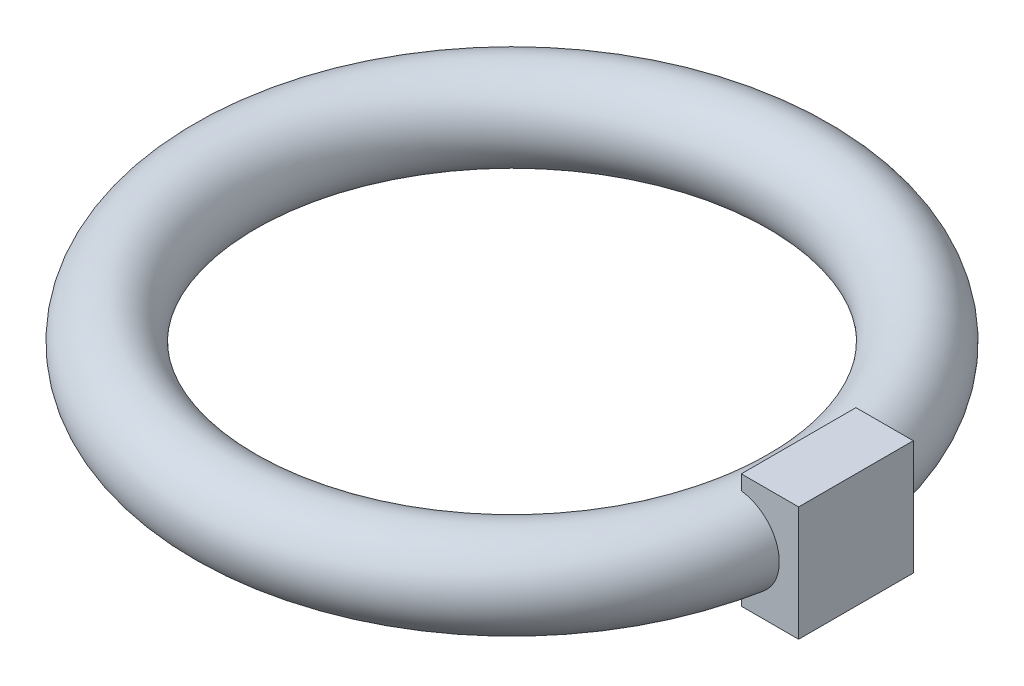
ISO-10303-21;
HEADER;
FILE_DESCRIPTION(('STEP AP214'),'2;1');
FILE_NAME('part.step','',(''),(''),'','','');
FILE_SCHEMA(('AUTOMOTIVE_DESIGN { 1 0 10303 214 1 1 1 1 }'));
ENDSEC;
DATA;
#1=APPLICATION_CONTEXT('core data for automotive mechanical design processes');
#2=APPLICATION_PROTOCOL_DEFINITION('international standard','automotive_design',2000,#1);
#3=PRODUCT_CONTEXT('',#1,'mechanical');
#4=PRODUCT('Part','Part','',(#3));
#5=PRODUCT_RELATED_PRODUCT_CATEGORY('part','',(#4));
#6=PRODUCT_DEFINITION_FORMATION('','',#4);
#7=PRODUCT_DEFINITION_CONTEXT('part definition',#1,'design');
#8=PRODUCT_DEFINITION('design','',#6,#7);
#9=PRODUCT_DEFINITION_SHAPE('','',#8);
#10=(LENGTH_UNIT() NAMED_UNIT(*) SI_UNIT(.MILLI.,.METRE.));
#11=(NAMED_UNIT(*) PLANE_ANGLE_UNIT() SI_UNIT($,.RADIAN.));
#12=(NAMED_UNIT(*) SI_UNIT($,.STERADIAN.) SOLID_ANGLE_UNIT());
#13=UNCERTAINTY_MEASURE_WITH_UNIT(LENGTH_MEASURE(1.E-05),#10,'distance_accuracy_value','');
#14=(GEOMETRIC_REPRESENTATION_CONTEXT(3) GLOBAL_UNCERTAINTY_ASSIGNED_CONTEXT((#13)) GLOBAL_UNIT_ASSIGNED_CONTEXT((#10,
#11,#12)) REPRESENTATION_CONTEXT('',''));
#15=CARTESIAN_POINT('',(0.,0.,0.));
#16=DIRECTION('',(0.,0.,1.));
#17=DIRECTION('',(1.,0.,0.));
#18=AXIS2_PLACEMENT_3D('',#15,#16,#17);
#19=CARTESIAN_POINT('',(100.,10.,-10.));
#20=DIRECTION('',(0.,0.,-1.));
#21=DIRECTION('',(-1.,0.,0.));
#22=AXIS2_PLACEMENT_3D('',#19,#20,#21);
#23=PLANE('',#22);
#24=CARTESIAN_POINT('',(102.409991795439,-6.70751476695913,-10.));
#25=CARTESIAN_POINT('',(102.214356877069,-6.80364922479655,-10.));
#26=CARTESIAN_POINT('',(102.014640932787,-6.89143819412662,-10.));
#27=CARTESIAN_POINT('',(101.608421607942,-7.04980923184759,-10.));
#28=CARTESIAN_POINT('',(101.40191616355,-7.12038601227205,-10.));
#29=CARTESIAN_POINT('',(100.983466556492,-7.24391992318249,-10.));
#30=CARTESIAN_POINT('',(100.771516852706,-7.29685826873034,-10.));
#31=CARTESIAN_POINT('',(100.343833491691,-7.38471512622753,-10.));
#32=CARTESIAN_POINT('',(100.128098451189,-7.41962690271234,-10.));
#33=CARTESIAN_POINT('',(99.6947586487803,-7.47117090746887,-10.));
#34=CARTESIAN_POINT('',(99.477156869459,-7.48782823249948,-10.));
#35=CARTESIAN_POINT('',(99.0412432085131,-7.50287672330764,-10.));
#36=CARTESIAN_POINT('',(98.8229310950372,-7.5012611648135,-10.));
#37=CARTESIAN_POINT('',(98.3873455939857,-7.47979390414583,-10.));
#38=CARTESIAN_POINT('',(98.1700716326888,-7.45995383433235,-10.));
#39=CARTESIAN_POINT('',(97.7378574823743,-7.40219437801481,-10.));
#40=CARTESIAN_POINT('',(97.5229182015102,-7.36426819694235,-10.));
#41=CARTESIAN_POINT('',(97.0954188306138,-7.27025564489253,-10.));
#42=CARTESIAN_POINT('',(96.8828871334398,-7.21404010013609,-10.));
#43=CARTESIAN_POINT('',(96.4632176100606,-7.08387597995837,-10.));
#44=CARTESIAN_POINT('',(96.2560823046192,-7.00991927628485,-10.));
#45=CARTESIAN_POINT('',(95.8487807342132,-6.84476733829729,-10.));
#46=CARTESIAN_POINT('',(95.6486150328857,-6.75357071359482,-10.));
#47=CARTESIAN_POINT('',(95.2568224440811,-6.55458729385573,-10.));
#48=CARTESIAN_POINT('',(95.0651916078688,-6.44680827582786,-10.));
#49=CARTESIAN_POINT('',(94.6921889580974,-6.21558370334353,-10.));
#50=CARTESIAN_POINT('',(94.5107961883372,-6.09217196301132,-10.));
#51=CARTESIAN_POINT('',(94.1592703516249,-5.83037041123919,-10.));
#52=CARTESIAN_POINT('',(93.9891328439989,-5.69198656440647,-10.));
#53=CARTESIAN_POINT('',(93.6613011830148,-5.4010794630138,-10.));
#54=CARTESIAN_POINT('',(93.5036112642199,-5.24855143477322,-10.));
#55=CARTESIAN_POINT('',(93.2020570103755,-4.93050348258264,-10.));
#56=CARTESIAN_POINT('',(93.0581870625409,-4.76498888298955,-10.));
#57=CARTESIAN_POINT('',(92.7877468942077,-4.42504647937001,-10.));
#58=CARTESIAN_POINT('',(92.6609201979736,-4.25082270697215,-10.));
#59=CARTESIAN_POINT('',(92.4227709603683,-3.89217415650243,-10.));
#60=CARTESIAN_POINT('',(92.31144245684,-3.70775333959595,-10.));
#61=CARTESIAN_POINT('',(92.1051642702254,-3.32995084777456,-10.));
#62=CARTESIAN_POINT('',(92.0102155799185,-3.13656863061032,-10.));
#63=CARTESIAN_POINT('',(91.8375293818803,-2.74226578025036,-10.));
#64=CARTESIAN_POINT('',(91.7597915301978,-2.54134529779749,-10.));
#65=CARTESIAN_POINT('',(91.6240040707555,-2.13876585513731,-10.));
#66=CARTESIAN_POINT('',(91.5654956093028,-1.93726156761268,-10.));
#67=CARTESIAN_POINT('',(91.4659652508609,-1.52998077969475,-10.));
#68=CARTESIAN_POINT('',(91.4249429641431,-1.32420437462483,-10.));
#69=CARTESIAN_POINT('',(91.3607466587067,-0.909907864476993,-10.));
#70=CARTESIAN_POINT('',(91.3375707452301,-0.701388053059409,-10.));
#71=CARTESIAN_POINT('',(91.3092652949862,-0.283127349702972,-10.));
#72=CARTESIAN_POINT('',(91.3041355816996,-0.0733864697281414,-10.));
#73=CARTESIAN_POINT('',(91.3118916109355,0.341715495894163,-10.));
#74=CARTESIAN_POINT('',(91.324432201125,0.547083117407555,-10.));
#75=CARTESIAN_POINT('',(91.3668135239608,0.956096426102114,-10.));
#76=CARTESIAN_POINT('',(91.3966601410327,1.1597415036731,-10.));
#77=CARTESIAN_POINT('',(91.4733965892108,1.56374796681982,-10.));
#78=CARTESIAN_POINT('',(91.5202827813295,1.76411004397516,-10.));
#79=CARTESIAN_POINT('',(91.6307078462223,2.16019519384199,-10.));
#80=CARTESIAN_POINT('',(91.6942471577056,2.35591814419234,-10.));
#81=CARTESIAN_POINT('',(91.8374724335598,2.74141608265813,-10.));
#82=CARTESIAN_POINT('',(91.9171623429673,2.9311896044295,-10.));
#83=CARTESIAN_POINT('',(92.0920389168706,3.30345821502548,-10.));
#84=CARTESIAN_POINT('',(92.1872258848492,3.48595316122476,-10.));
#85=CARTESIAN_POINT('',(92.3923355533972,3.84243207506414,-10.));
#86=CARTESIAN_POINT('',(92.50225643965,4.01641708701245,-10.));
#87=CARTESIAN_POINT('',(92.7360438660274,4.35483621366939,-10.));
#88=CARTESIAN_POINT('',(92.8599152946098,4.51926694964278,-10.));
#89=CARTESIAN_POINT('',(93.1230849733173,4.84044269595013,-10.));
#90=CARTESIAN_POINT('',(93.2626276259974,4.99698745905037,-10.));
#91=CARTESIAN_POINT('',(93.5542073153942,5.2980792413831,-10.));
#92=CARTESIAN_POINT('',(93.7062489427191,5.44262181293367,-10.));
#93=CARTESIAN_POINT('',(94.0216362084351,5.71870692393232,-10.));
#94=CARTESIAN_POINT('',(94.1849788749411,5.85025285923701,-10.));
#95=CARTESIAN_POINT('',(94.5219097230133,6.09962751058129,-10.));
#96=CARTESIAN_POINT('',(94.6955017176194,6.21745107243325,-10.));
#97=CARTESIAN_POINT('',(95.0561696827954,6.44140136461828,-10.));
#98=CARTESIAN_POINT('',(95.2434752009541,6.54715855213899,-10.));
#99=CARTESIAN_POINT('',(95.6262762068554,6.74281764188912,-10.));
#100=CARTESIAN_POINT('',(95.8217747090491,6.83271364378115,-10.));
#101=CARTESIAN_POINT('',(96.2195118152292,6.99603081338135,-10.));
#102=CARTESIAN_POINT('',(96.4217497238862,7.06945367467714,-10.));
#103=CARTESIAN_POINT('',(96.8315960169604,7.19937510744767,-10.));
#104=CARTESIAN_POINT('',(97.0392045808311,7.25587311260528,-10.));
#105=CARTESIAN_POINT('',(97.462216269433,7.35245769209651,-10.));
#106=CARTESIAN_POINT('',(97.6776925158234,7.39222430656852,-10.));
#107=CARTESIAN_POINT('',(98.111222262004,7.45355338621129,-10.));
#108=CARTESIAN_POINT('',(98.3292757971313,7.47511560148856,-10.));
#109=CARTESIAN_POINT('',(98.7664348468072,7.49987289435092,-10.));
#110=CARTESIAN_POINT('',(98.9855404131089,7.50306705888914,-10.));
#111=CARTESIAN_POINT('',(99.4232405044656,7.49103619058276,-10.));
#112=CARTESIAN_POINT('',(99.6418350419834,7.47581161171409,-10.));
#113=CARTESIAN_POINT('',(100.077859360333,7.42691043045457,-10.));
#114=CARTESIAN_POINT('',(100.295280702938,7.39315850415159,-10.));
#115=CARTESIAN_POINT('',(100.726403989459,7.30735558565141,-10.));
#116=CARTESIAN_POINT('',(100.940107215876,7.25531103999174,-10.));
#117=CARTESIAN_POINT('',(101.362350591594,7.13322304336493,-10.));
#118=CARTESIAN_POINT('',(101.57088985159,7.06317651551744,-10.));
#119=CARTESIAN_POINT('',(101.981219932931,6.90553132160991,-10.));
#120=CARTESIAN_POINT('',(102.183010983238,6.81793325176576,-10.));
#121=CARTESIAN_POINT('',(102.576489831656,6.62665277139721,-10.));
#122=CARTESIAN_POINT('',(102.768254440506,6.52312836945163,-10.));
#123=CARTESIAN_POINT('',(103.142246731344,6.30009587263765,-10.));
#124=CARTESIAN_POINT('',(103.324474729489,6.18058830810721,-10.));
#125=CARTESIAN_POINT('',(103.678044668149,5.92637462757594,-10.));
#126=CARTESIAN_POINT('',(103.84938501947,5.79166630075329,-10.));
#127=CARTESIAN_POINT('',(104.179767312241,5.50805109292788,-10.));
#128=CARTESIAN_POINT('',(104.338814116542,5.35914987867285,-10.));
#129=CARTESIAN_POINT('',(104.641001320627,5.05064810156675,-10.));
#130=CARTESIAN_POINT('',(104.78435566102,4.89125706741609,-10.));
#131=CARTESIAN_POINT('',(105.056878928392,4.56087387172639,-10.));
#132=CARTESIAN_POINT('',(105.186053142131,4.38988607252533,-10.));
#133=CARTESIAN_POINT('',(105.42928846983,4.03744882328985,-10.));
#134=CARTESIAN_POINT('',(105.543347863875,3.85599818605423,-10.));
#135=CARTESIAN_POINT('',(105.755440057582,3.48396013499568,-10.));
#136=CARTESIAN_POINT('',(105.853473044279,3.29337282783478,-10.));
#137=CARTESIAN_POINT('',(106.031271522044,2.90762922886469,-10.));
#138=CARTESIAN_POINT('',(106.111309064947,2.71259829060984,-10.));
#139=CARTESIAN_POINT('',(106.2545055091,2.31643487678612,-10.));
#140=CARTESIAN_POINT('',(106.317664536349,2.1153024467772,-10.));
#141=CARTESIAN_POINT('',(106.4266088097,1.70839522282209,-10.));
#142=CARTESIAN_POINT('',(106.472394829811,1.50262063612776,-10.));
#143=CARTESIAN_POINT('',(106.546236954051,1.08791898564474,-10.));
#144=CARTESIAN_POINT('',(106.574293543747,0.878992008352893,-10.));
#145=CARTESIAN_POINT('',(106.612249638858,0.461795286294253,-10.));
#146=CARTESIAN_POINT('',(106.622343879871,0.253543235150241,-10.));
#147=CARTESIAN_POINT('',(106.624895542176,-0.163064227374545,-10.));
#148=CARTESIAN_POINT('',(106.617353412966,-0.371419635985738,-10.));
#149=CARTESIAN_POINT('',(106.584689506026,-0.78677106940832,-10.));
#150=CARTESIAN_POINT('',(106.559565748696,-0.993766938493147,-10.));
#151=CARTESIAN_POINT('',(106.491941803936,-1.4048269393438,-10.));
#152=CARTESIAN_POINT('',(106.449447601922,-1.608892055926,-10.));
#153=CARTESIAN_POINT('',(106.34754515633,-2.01217614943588,-10.));
#154=CARTESIAN_POINT('',(106.28818216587,-2.2114065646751,-10.));
#155=CARTESIAN_POINT('',(106.15294970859,-2.60417750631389,-10.));
#156=CARTESIAN_POINT('',(106.077080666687,-2.7977181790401,-10.));
#157=CARTESIAN_POINT('',(105.909384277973,-3.17782055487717,-10.));
#158=CARTESIAN_POINT('',(105.817552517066,-3.36438031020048,-10.));
#159=CARTESIAN_POINT('',(105.618633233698,-3.72917792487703,-10.));
#160=CARTESIAN_POINT('',(105.511545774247,-3.90741581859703,-10.));
#161=CARTESIAN_POINT('',(105.282144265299,-4.25551740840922,-10.));
#162=CARTESIAN_POINT('',(105.159733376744,-4.4253172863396,-10.));
#163=CARTESIAN_POINT('',(104.901210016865,-4.75404515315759,-10.));
#164=CARTESIAN_POINT('',(104.765102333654,-4.91297690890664,-10.));
#165=CARTESIAN_POINT('',(104.480268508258,-5.21884169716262,-10.));
#166=CARTESIAN_POINT('',(104.331553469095,-5.36578506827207,-10.));
#167=CARTESIAN_POINT('',(104.022528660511,-5.6468224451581,-10.));
#168=CARTESIAN_POINT('',(103.86222192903,-5.78091979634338,-10.));
#169=CARTESIAN_POINT('',(103.496182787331,-6.0623000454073,-10.));
#170=CARTESIAN_POINT('',(103.287996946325,-6.20640594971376,-10.));
#171=CARTESIAN_POINT('',(102.858368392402,-6.47325589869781,-10.));
#172=CARTESIAN_POINT('',(102.636925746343,-6.59600005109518,-10.));
#173=CARTESIAN_POINT('',(102.409991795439,-6.70751476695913,-10.));
#174=B_SPLINE_CURVE_WITH_KNOTS('',3,(#24,#25,#26,#27,#28,#29,#30,#31,#32,#33,#34,#35,#36,#37,
#38,#39,#40,#41,#42,#43,#44,#45,#46,#47,#48,#49,#50,#51,#52,#53,#54,#55,#56,#57,#58,#59,#60,#61,
#62,#63,#64,#65,#66,#67,#68,#69,#70,#71,#72,#73,#74,#75,#76,#77,#78,#79,#80,#81,#82,#83,#84,#85,
#86,#87,#88,#89,#90,#91,#92,#93,#94,#95,#96,#97,#98,#99,#100,#101,#102,#103,#104,#105,#106,#107,
#108,#109,#110,#111,#112,#113,#114,#115,#116,#117,#118,#119,#120,#121,#122,#123,#124,#125,#126,
#127,#128,#129,#130,#131,#132,#133,#134,#135,#136,#137,#138,#139,#140,#141,#142,#143,#144,#145,
#146,#147,#148,#149,#150,#151,#152,#153,#154,#155,#156,#157,#158,#159,#160,#161,#162,#163,#164,
#165,#166,#167,#168,#169,#170,#171,#172,#173),.UNSPECIFIED.,.T.,.F.,(4,2,2,2,2,2,2,2,2,2,2,2,2,
2,2,2,2,2,2,2,2,2,2,2,2,2,2,2,2,2,2,2,2,2,2,2,2,2,2,2,2,2,2,2,2,2,2,2,2,2,2,2,2,2,2,2,2,2,2,2,2,
2,2,2,2,2,2,2,2,2,2,2,2,2,4),(0.,0.653710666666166,1.30762191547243,1.96222737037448,
2.61707723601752,3.27102566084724,3.92521474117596,4.57898655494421,5.23300417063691,
5.89174506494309,6.55078834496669,7.20988479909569,7.86867307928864,8.52605996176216,
9.18318591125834,9.84053445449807,10.4976148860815,11.1433145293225,11.78876508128,
12.4342547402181,13.0797314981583,13.7084460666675,14.3371466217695,14.9657804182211,
15.5944080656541,16.2109256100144,16.827652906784,17.4442485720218,18.0608604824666,
18.6776231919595,19.2943979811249,19.9110968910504,20.5280125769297,21.1564210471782,
21.7850613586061,22.4135369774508,23.0422478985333,23.6868009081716,24.3315931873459,
24.9763191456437,25.6210666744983,26.2776378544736,26.9342180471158,27.590830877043,
28.2474275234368,28.9067135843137,29.5657675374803,30.2249342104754,30.8840784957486,
31.537061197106,32.190022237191,32.8430783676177,33.4958748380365,34.1382172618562,
34.7803193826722,35.422494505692,36.0646621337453,36.6963480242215,37.3280291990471,
37.9596822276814,38.5913179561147,39.2160632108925,39.8407925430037,40.4655922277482,
41.0901768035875,41.7131014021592,42.3360099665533,42.9590910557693,43.5821695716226,
44.2094059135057,44.8364237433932,45.4628949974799,46.0892026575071,46.847502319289,
47.6057981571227),.UNSPECIFIED.);
#175=CARTESIAN_POINT('',(100.,7.43434688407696,-10.));
#176=VERTEX_POINT('',#175);
#177=CARTESIAN_POINT('',(100.,-7.43434688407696,-10.));
#178=VERTEX_POINT('',#177);
#179=EDGE_CURVE('E37',#176,#178,#174,.T.);
#180=ORIENTED_EDGE('',*,*,#179,.F.);
#181=DIRECTION('',(0.,1.,0.));
#182=VECTOR('',#181,1.);
#183=CARTESIAN_POINT('',(100.,10.,-10.));
#184=LINE('',#183,#182);
#185=CARTESIAN_POINT('',(100.,10.,-10.));
#186=VERTEX_POINT('',#185);
#187=EDGE_CURVE('E53',#176,#186,#184,.T.);
#188=ORIENTED_EDGE('',*,*,#187,.T.);
#189=DIRECTION('',(1.,0.,0.));
#190=VECTOR('',#189,1.);
#191=CARTESIAN_POINT('',(100.,10.,-10.));
#192=LINE('',#191,#190);
#193=CARTESIAN_POINT('',(110.,10.,-10.));
#194=VERTEX_POINT('',#193);
#195=EDGE_CURVE('E92',#186,#194,#192,.T.);
#196=ORIENTED_EDGE('',*,*,#195,.T.);
#197=DIRECTION('',(0.,1.,0.));
#198=VECTOR('',#197,1.);
#199=CARTESIAN_POINT('',(110.,10.,-10.));
#200=LINE('',#199,#198);
#201=CARTESIAN_POINT('',(110.,-10.,-10.));
#202=VERTEX_POINT('',#201);
#203=EDGE_CURVE('E119',#202,#194,#200,.T.);
#204=ORIENTED_EDGE('',*,*,#203,.F.);
#205=DIRECTION('',(1.,0.,0.));
#206=VECTOR('',#205,1.);
#207=CARTESIAN_POINT('',(100.,-10.,-10.));
#208=LINE('',#207,#206);
#209=CARTESIAN_POINT('',(100.,-10.,-10.));
#210=VERTEX_POINT('',#209);
#211=EDGE_CURVE('E127',#210,#202,#208,.T.);
#212=ORIENTED_EDGE('',*,*,#211,.F.);
#213=EDGE_CURVE('E97',#210,#178,#184,.T.);
#214=ORIENTED_EDGE('',*,*,#213,.T.);
#215=EDGE_LOOP('',(#180,#188,#196,#204,#212,#214));
#216=FACE_BOUND('',#215,.T.);
#217=ADVANCED_FACE('F32',(#216),#23,.T.);
#218=CARTESIAN_POINT('',(100.,10.,10.));
#219=DIRECTION('',(0.,0.,1.));
#220=DIRECTION('',(1.,0.,0.));
#221=AXIS2_PLACEMENT_3D('',#218,#219,#220);
#222=PLANE('',#221);
#223=CARTESIAN_POINT('',(102.409991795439,-6.70751476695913,10.));
#224=CARTESIAN_POINT('',(102.601083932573,-6.61361595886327,10.));
#225=CARTESIAN_POINT('',(102.788238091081,-6.51177532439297,10.));
#226=CARTESIAN_POINT('',(103.153453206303,-6.2927982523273,10.));
#227=CARTESIAN_POINT('',(103.331512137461,-6.17565842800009,10.));
#228=CARTESIAN_POINT('',(103.677308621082,-5.92677142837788,10.));
#229=CARTESIAN_POINT('',(103.845038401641,-5.79501345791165,10.));
#230=CARTESIAN_POINT('',(104.168859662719,-5.51778117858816,10.));
#231=CARTESIAN_POINT('',(104.324946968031,-5.37230199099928,10.));
#232=CARTESIAN_POINT('',(104.624258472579,-5.06864036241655,10.));
#233=CARTESIAN_POINT('',(104.767481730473,-4.91045699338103,10.));
#234=CARTESIAN_POINT('',(105.039966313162,-4.58248654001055,10.));
#235=CARTESIAN_POINT('',(105.169227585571,-4.41269941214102,10.));
#236=CARTESIAN_POINT('',(105.412763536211,-4.06275752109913,10.));
#237=CARTESIAN_POINT('',(105.527041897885,-3.88260532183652,10.));
#238=CARTESIAN_POINT('',(105.739762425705,-3.51317639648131,10.));
#239=CARTESIAN_POINT('',(105.838204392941,-3.32389955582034,10.));
#240=CARTESIAN_POINT('',(106.017406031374,-2.93988678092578,10.));
#241=CARTESIAN_POINT('',(106.098361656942,-2.74524227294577,10.));
#242=CARTESIAN_POINT('',(106.243452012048,-2.34970338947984,10.));
#243=CARTESIAN_POINT('',(106.307580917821,-2.14880687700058,10.));
#244=CARTESIAN_POINT('',(106.41845871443,-1.74235613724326,10.));
#245=CARTESIAN_POINT('',(106.465214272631,-1.53680372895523,10.));
#246=CARTESIAN_POINT('',(106.54102733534,-1.12238124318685,10.));
#247=CARTESIAN_POINT('',(106.570078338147,-0.913509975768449,10.));
#248=CARTESIAN_POINT('',(106.610001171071,-0.496404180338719,10.));
#249=CARTESIAN_POINT('',(106.621073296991,-0.288188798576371,10.));
#250=CARTESIAN_POINT('',(106.625579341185,0.12843569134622,10.));
#251=CARTESIAN_POINT('',(106.619013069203,0.336844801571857,10.));
#252=CARTESIAN_POINT('',(106.588293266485,0.752351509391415,10.));
#253=CARTESIAN_POINT('',(106.564140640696,0.959449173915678,10.));
#254=CARTESIAN_POINT('',(106.498434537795,1.37087025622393,10.));
#255=CARTESIAN_POINT('',(106.456880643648,1.57519360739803,10.));
#256=CARTESIAN_POINT('',(106.356843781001,1.97899251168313,10.));
#257=CARTESIAN_POINT('',(106.298412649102,2.1784809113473,10.));
#258=CARTESIAN_POINT('',(106.164993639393,2.57191767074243,10.));
#259=CARTESIAN_POINT('',(106.0900000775,2.7658641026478,10.));
#260=CARTESIAN_POINT('',(105.924048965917,3.14675974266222,10.));
#261=CARTESIAN_POINT('',(105.833094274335,3.3337101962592,10.));
#262=CARTESIAN_POINT('',(105.635890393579,3.69936662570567,10.));
#263=CARTESIAN_POINT('',(105.529640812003,3.87807238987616,10.));
#264=CARTESIAN_POINT('',(105.301969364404,4.22704070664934,10.));
#265=CARTESIAN_POINT('',(105.180462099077,4.39724754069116,10.));
#266=CARTESIAN_POINT('',(104.923669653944,4.72693328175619,10.));
#267=CARTESIAN_POINT('',(104.788384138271,4.88641192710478,10.));
#268=CARTESIAN_POINT('',(104.505048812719,5.19355113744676,10.));
#269=CARTESIAN_POINT('',(104.35700083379,5.34121339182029,10.));
#270=CARTESIAN_POINT('',(104.049140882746,5.62382724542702,10.));
#271=CARTESIAN_POINT('',(103.889324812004,5.75877437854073,10.));
#272=CARTESIAN_POINT('',(103.557004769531,6.01666968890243,10.));
#273=CARTESIAN_POINT('',(103.384364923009,6.13944279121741,10.));
#274=CARTESIAN_POINT('',(103.029413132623,6.37025495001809,10.));
#275=CARTESIAN_POINT('',(102.847097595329,6.4782884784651,10.));
#276=CARTESIAN_POINT('',(102.474213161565,6.67885362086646,10.));
#277=CARTESIAN_POINT('',(102.283647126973,6.77139055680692,10.));
#278=CARTESIAN_POINT('',(101.895450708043,6.9404791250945,10.));
#279=CARTESIAN_POINT('',(101.69781716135,7.01702349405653,10.));
#280=CARTESIAN_POINT('',(101.29356078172,7.1547675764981,10.));
#281=CARTESIAN_POINT('',(101.086842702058,7.21568784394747,10.));
#282=CARTESIAN_POINT('',(100.669145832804,7.32009208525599,10.));
#283=CARTESIAN_POINT('',(100.458168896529,7.36358347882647,10.));
#284=CARTESIAN_POINT('',(100.033236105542,7.4329394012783,10.));
#285=CARTESIAN_POINT('',(99.819278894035,7.45879561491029,10.));
#286=CARTESIAN_POINT('',(99.3900374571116,7.49271070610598,10.));
#287=CARTESIAN_POINT('',(99.17475373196,7.50077592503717,10.));
#288=CARTESIAN_POINT('',(98.7409536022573,7.49909383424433,10.));
#289=CARTESIAN_POINT('',(98.5224382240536,7.4890716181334,10.));
#290=CARTESIAN_POINT('',(98.0870921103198,7.45077581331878,10.));
#291=CARTESIAN_POINT('',(97.8702608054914,7.42250869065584,10.));
#292=CARTESIAN_POINT('',(97.4396316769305,7.34791660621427,10.));
#293=CARTESIAN_POINT('',(97.2258351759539,7.30158400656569,10.));
#294=CARTESIAN_POINT('',(96.802952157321,7.19119505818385,10.));
#295=CARTESIAN_POINT('',(96.5938639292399,7.12714526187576,10.));
#296=CARTESIAN_POINT('',(96.18043507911,6.98125522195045,10.));
#297=CARTESIAN_POINT('',(95.9761348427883,6.89930047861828,10.));
#298=CARTESIAN_POINT('',(95.5752744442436,6.71842227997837,10.));
#299=CARTESIAN_POINT('',(95.3787115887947,6.61950479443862,10.));
#300=CARTESIAN_POINT('',(94.9946590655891,6.40530994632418,10.));
#301=CARTESIAN_POINT('',(94.8071711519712,6.29002943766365,10.));
#302=CARTESIAN_POINT('',(94.4427228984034,6.04388849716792,10.));
#303=CARTESIAN_POINT('',(94.2657621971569,5.91302860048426,10.));
#304=CARTESIAN_POINT('',(93.9251197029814,5.63773113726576,10.));
#305=CARTESIAN_POINT('',(93.7613413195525,5.49341310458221,10.));
#306=CARTESIAN_POINT('',(93.4467515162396,5.19128188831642,10.));
#307=CARTESIAN_POINT('',(93.295939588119,5.033469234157,10.));
#308=CARTESIAN_POINT('',(93.0084645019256,4.70540392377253,10.));
#309=CARTESIAN_POINT('',(92.8718031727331,4.53514966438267,10.));
#310=CARTESIAN_POINT('',(92.6138318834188,4.18348485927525,10.));
#311=CARTESIAN_POINT('',(92.4925156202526,4.00207893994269,10.));
#312=CARTESIAN_POINT('',(92.268659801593,3.63340443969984,10.));
#313=CARTESIAN_POINT('',(92.1657698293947,3.44634859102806,10.));
#314=CARTESIAN_POINT('',(91.9765053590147,3.06414564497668,10.));
#315=CARTESIAN_POINT('',(91.8901244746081,2.86900171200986,10.));
#316=CARTESIAN_POINT('',(91.7345691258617,2.47195747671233,10.));
#317=CARTESIAN_POINT('',(91.6653956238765,2.27005679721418,10.));
#318=CARTESIAN_POINT('',(91.5448719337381,1.86100362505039,10.));
#319=CARTESIAN_POINT('',(91.493521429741,1.65385122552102,10.));
#320=CARTESIAN_POINT('',(91.4101758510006,1.24116326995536,10.));
#321=CARTESIAN_POINT('',(91.3777225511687,1.03572014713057,10.));
#322=CARTESIAN_POINT('',(91.3304627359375,0.622814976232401,10.));
#323=CARTESIAN_POINT('',(91.3156559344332,0.415352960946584,10.));
#324=CARTESIAN_POINT('',(91.3038184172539,-5.96479183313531E-05,10.));
#325=CARTESIAN_POINT('',(91.3067861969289,-0.208010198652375,10.));
#326=CARTESIAN_POINT('',(91.3304684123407,-0.622897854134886,10.));
#327=CARTESIAN_POINT('',(91.3511827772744,-0.82983496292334,10.));
#328=CARTESIAN_POINT('',(91.4097908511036,-1.23849468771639,10.));
#329=CARTESIAN_POINT('',(91.4474562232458,-1.44025010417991,10.));
#330=CARTESIAN_POINT('',(91.5395950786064,-1.8399571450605,10.));
#331=CARTESIAN_POINT('',(91.5940742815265,-2.03790745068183,10.));
#332=CARTESIAN_POINT('',(91.7193637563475,-2.42849197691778,10.));
#333=CARTESIAN_POINT('',(91.790168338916,-2.62112802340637,10.));
#334=CARTESIAN_POINT('',(91.9475739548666,-2.99991566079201,10.));
#335=CARTESIAN_POINT('',(92.034180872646,-3.18606480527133,10.));
#336=CARTESIAN_POINT('',(92.2232007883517,-3.55194333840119,10.));
#337=CARTESIAN_POINT('',(92.3257284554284,-3.73161347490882,10.));
#338=CARTESIAN_POINT('',(92.5453427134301,-4.08191119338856,10.));
#339=CARTESIAN_POINT('',(92.6624346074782,-4.25253544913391,10.));
#340=CARTESIAN_POINT('',(92.9102416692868,-4.58355150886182,10.));
#341=CARTESIAN_POINT('',(93.0409552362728,-4.74394451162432,10.));
#342=CARTESIAN_POINT('',(93.3150553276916,-5.05351683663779,10.));
#343=CARTESIAN_POINT('',(93.4584424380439,-5.20269563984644,10.));
#344=CARTESIAN_POINT('',(93.7603070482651,-5.49222507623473,10.));
#345=CARTESIAN_POINT('',(93.9190567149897,-5.63229200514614,10.));
#346=CARTESIAN_POINT('',(94.2475797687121,-5.89883708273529,10.));
#347=CARTESIAN_POINT('',(94.4173533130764,-6.02531503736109,10.));
#348=CARTESIAN_POINT('',(94.7667258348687,-6.2639055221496,10.));
#349=CARTESIAN_POINT('',(94.9463254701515,-6.376017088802,10.));
#350=CARTESIAN_POINT('',(95.3140874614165,-6.58517771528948,10.));
#351=CARTESIAN_POINT('',(95.5022498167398,-6.68222677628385,10.));
#352=CARTESIAN_POINT('',(95.8905367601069,-6.86285071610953,10.));
#353=CARTESIAN_POINT('',(96.0908411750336,-6.94603922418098,10.));
#354=CARTESIAN_POINT('',(96.4976060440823,-7.09543342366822,10.));
#355=CARTESIAN_POINT('',(96.7040643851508,-7.16164487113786,10.));
#356=CARTESIAN_POINT('',(97.1219066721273,-7.27673513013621,10.));
#357=CARTESIAN_POINT('',(97.3332938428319,-7.32560223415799,10.));
#358=CARTESIAN_POINT('',(97.7593176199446,-7.40560423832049,10.));
#359=CARTESIAN_POINT('',(97.9739530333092,-7.4367454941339,10.));
#360=CARTESIAN_POINT('',(98.4081533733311,-7.48142320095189,10.));
#361=CARTESIAN_POINT('',(98.6277449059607,-7.49470160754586,10.));
#362=CARTESIAN_POINT('',(99.0671857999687,-7.50270548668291,10.));
#363=CARTESIAN_POINT('',(99.2870350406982,-7.49743760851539,10.));
#364=CARTESIAN_POINT('',(99.7253241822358,-7.46837757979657,10.));
#365=CARTESIAN_POINT('',(99.943765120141,-7.44460114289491,10.));
#366=CARTESIAN_POINT('',(100.377785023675,-7.3786808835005,10.));
#367=CARTESIAN_POINT('',(100.593364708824,-7.33654177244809,10.));
#368=CARTESIAN_POINT('',(101.083513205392,-7.21893172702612,10.));
#369=CARTESIAN_POINT('',(101.356622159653,-7.13728268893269,10.));
#370=CARTESIAN_POINT('',(101.892162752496,-6.9443227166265,10.));
#371=CARTESIAN_POINT('',(102.154594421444,-6.83301186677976,10.));
#372=CARTESIAN_POINT('',(102.409991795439,-6.70751476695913,10.));
#373=B_SPLINE_CURVE_WITH_KNOTS('',3,(#223,#224,#225,#226,#227,#228,#229,#230,#231,#232,#233,
#234,#235,#236,#237,#238,#239,#240,#241,#242,#243,#244,#245,#246,#247,#248,#249,#250,#251,#252,
#253,#254,#255,#256,#257,#258,#259,#260,#261,#262,#263,#264,#265,#266,#267,#268,#269,#270,#271,
#272,#273,#274,#275,#276,#277,#278,#279,#280,#281,#282,#283,#284,#285,#286,#287,#288,#289,#290,
#291,#292,#293,#294,#295,#296,#297,#298,#299,#300,#301,#302,#303,#304,#305,#306,#307,#308,#309,
#310,#311,#312,#313,#314,#315,#316,#317,#318,#319,#320,#321,#322,#323,#324,#325,#326,#327,#328,
#329,#330,#331,#332,#333,#334,#335,#336,#337,#338,#339,#340,#341,#342,#343,#344,#345,#346,#347,
#348,#349,#350,#351,#352,#353,#354,#355,#356,#357,#358,#359,#360,#361,#362,#363,#364,#365,#366,
#367,#368,#369,#370,#371,#372),.UNSPECIFIED.,.T.,.F.,(4,2,2,2,2,2,2,2,2,2,2,2,2,2,2,2,2,2,2,2,2,
2,2,2,2,2,2,2,2,2,2,2,2,2,2,2,2,2,2,2,2,2,2,2,2,2,2,2,2,2,2,2,2,2,2,2,2,2,2,2,2,2,2,2,2,2,2,2,2,
2,2,2,2,2,4),(0.,0.638506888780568,1.27715536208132,1.91627864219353,2.55563003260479,
3.19502817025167,3.83442870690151,4.47367175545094,5.11292283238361,5.74458867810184,
6.37647285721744,7.00811428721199,7.63998753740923,8.26477179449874,8.88956279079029,
9.51432163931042,10.1390954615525,10.7619704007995,11.385059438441,12.0080370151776,
12.6310305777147,13.2576810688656,13.8843468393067,14.5109228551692,15.1377181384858,
15.7725111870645,16.4075416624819,17.0423536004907,17.6774532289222,18.3232243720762,
18.9687203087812,19.6145203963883,20.2600902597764,20.9155547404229,21.5707870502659,
22.2262966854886,22.881564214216,23.5411515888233,24.2005073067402,24.8599899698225,
25.5194499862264,26.1735276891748,26.8275797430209,27.4817162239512,28.1355831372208,
28.7752568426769,29.4146825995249,30.0541441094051,30.6935942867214,31.3168128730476,
31.940021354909,32.5631770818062,33.1863303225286,33.8013296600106,34.4165384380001,
35.0315331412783,35.6467573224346,36.2666379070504,36.8867448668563,37.5067790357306,
38.1268418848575,38.7612348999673,39.3956369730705,40.0300815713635,40.6645261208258,
41.3144449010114,41.9641430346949,42.614278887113,43.2641814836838,43.9233751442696,
44.582332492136,45.2407309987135,45.8989606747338,46.7523366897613,47.6057102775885),.UNSPECIFIED.);
#374=CARTESIAN_POINT('',(100.,-7.43434688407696,10.));
#375=VERTEX_POINT('',#374);
#376=CARTESIAN_POINT('',(100.,7.43434688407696,10.));
#377=VERTEX_POINT('',#376);
#378=EDGE_CURVE('E61',#375,#377,#373,.T.);
#379=ORIENTED_EDGE('',*,*,#378,.F.);
#380=DIRECTION('',(0.,-1.,0.));
#381=VECTOR('',#380,1.);
#382=CARTESIAN_POINT('',(100.,10.,10.));
#383=LINE('',#382,#381);
#384=CARTESIAN_POINT('',(100.,-10.,10.));
#385=VERTEX_POINT('',#384);
#386=EDGE_CURVE('E113',#375,#385,#383,.T.);
#387=ORIENTED_EDGE('',*,*,#386,.T.);
#388=DIRECTION('',(1.,0.,0.));
#389=VECTOR('',#388,1.);
#390=CARTESIAN_POINT('',(100.,-10.,10.));
#391=LINE('',#390,#389);
#392=CARTESIAN_POINT('',(110.,-10.,10.));
#393=VERTEX_POINT('',#392);
#394=EDGE_CURVE('E129',#385,#393,#391,.T.);
#395=ORIENTED_EDGE('',*,*,#394,.T.);
#396=DIRECTION('',(0.,-1.,0.));
#397=VECTOR('',#396,1.);
#398=CARTESIAN_POINT('',(110.,10.,10.));
#399=LINE('',#398,#397);
#400=CARTESIAN_POINT('',(110.,10.,10.));
#401=VERTEX_POINT('',#400);
#402=EDGE_CURVE('E122',#401,#393,#399,.T.);
#403=ORIENTED_EDGE('',*,*,#402,.F.);
#404=DIRECTION('',(1.,0.,0.));
#405=VECTOR('',#404,1.);
#406=CARTESIAN_POINT('',(100.,10.,10.));
#407=LINE('',#406,#405);
#408=CARTESIAN_POINT('',(100.,10.,10.));
#409=VERTEX_POINT('',#408);
#410=EDGE_CURVE('E107',#409,#401,#407,.T.);
#411=ORIENTED_EDGE('',*,*,#410,.F.);
#412=EDGE_CURVE('E112',#409,#377,#383,.T.);
#413=ORIENTED_EDGE('',*,*,#412,.T.);
#414=EDGE_LOOP('',(#379,#387,#395,#403,#411,#413));
#415=FACE_BOUND('',#414,.T.);
#416=ADVANCED_FACE('F143',(#415),#222,.T.);
#417=CARTESIAN_POINT('',(100.,-10.,-10.));
#418=DIRECTION('',(-1.,0.,0.));
#419=DIRECTION('',(0.,0.,1.));
#420=AXIS2_PLACEMENT_3D('',#417,#418,#419);
#421=PLANE('',#420);
#422=CARTESIAN_POINT('',(100.,0.,-28.3945417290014));
#423=CARTESIAN_POINT('',(100.,-0.110428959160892,-28.3945420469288));
#424=CARTESIAN_POINT('',(100.,-0.220855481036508,-28.389592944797));
#425=CARTESIAN_POINT('',(100.,-0.440870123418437,-28.3699128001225));
#426=CARTESIAN_POINT('',(100.,-0.550457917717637,-28.3551781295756));
#427=CARTESIAN_POINT('',(100.,-0.76793797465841,-28.3162571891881));
#428=CARTESIAN_POINT('',(100.,-0.87583024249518,-28.2920709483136));
#429=CARTESIAN_POINT('',(100.,-1.08923411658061,-28.2347715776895));
#430=CARTESIAN_POINT('',(100.,-1.19474468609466,-28.2016546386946));
#431=CARTESIAN_POINT('',(100.,-1.50532416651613,-28.0903640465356));
#432=CARTESIAN_POINT('',(100.,-1.70610427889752,-27.9999375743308));
#433=CARTESIAN_POINT('',(100.,-2.0928681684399,-27.7921654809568));
#434=CARTESIAN_POINT('',(100.,-2.27884666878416,-27.6748103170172));
#435=CARTESIAN_POINT('',(100.,-2.754525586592,-27.3329841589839));
#436=CARTESIAN_POINT('',(100.,-3.03052370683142,-27.0893266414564));
#437=CARTESIAN_POINT('',(100.,-3.41353874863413,-26.6945542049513));
#438=CARTESIAN_POINT('',(100.,-3.53625615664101,-26.5577860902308));
#439=CARTESIAN_POINT('',(100.,-3.77205159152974,-26.2761571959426));
#440=CARTESIAN_POINT('',(100.,-3.88513151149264,-26.131298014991));
#441=CARTESIAN_POINT('',(100.,-4.18281657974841,-25.7251909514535));
#442=CARTESIAN_POINT('',(100.,-4.35830457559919,-25.4572664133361));
#443=CARTESIAN_POINT('',(100.,-4.68564381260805,-24.9072997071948));
#444=CARTESIAN_POINT('',(100.,-4.83747593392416,-24.6252463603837));
#445=CARTESIAN_POINT('',(100.,-5.12070513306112,-24.0507779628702));
#446=CARTESIAN_POINT('',(100.,-5.25208067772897,-23.7583523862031));
#447=CARTESIAN_POINT('',(100.,-5.49688103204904,-23.1662764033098));
#448=CARTESIAN_POINT('',(100.,-5.61031173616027,-22.8666284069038));
#449=CARTESIAN_POINT('',(100.,-5.86571663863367,-22.1357460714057));
#450=CARTESIAN_POINT('',(100.,-5.9998505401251,-21.7017790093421));
#451=CARTESIAN_POINT('',(100.,-6.24234397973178,-20.8266189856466));
#452=CARTESIAN_POINT('',(100.,-6.35069057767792,-20.385422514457));
#453=CARTESIAN_POINT('',(100.,-6.54606541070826,-19.497514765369));
#454=CARTESIAN_POINT('',(100.,-6.63305279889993,-19.0507946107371));
#455=CARTESIAN_POINT('',(100.,-6.78901486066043,-18.154347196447));
#456=CARTESIAN_POINT('',(100.,-6.8579925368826,-17.7046204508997));
#457=CARTESIAN_POINT('',(100.,-6.9813695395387,-16.8000589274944));
#458=CARTESIAN_POINT('',(100.,-7.03566559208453,-16.3452102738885));
#459=CARTESIAN_POINT('',(100.,-7.13164533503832,-15.434189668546));
#460=CARTESIAN_POINT('',(100.,-7.17332854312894,-14.9780176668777));
#461=CARTESIAN_POINT('',(100.,-7.24627067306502,-14.0653487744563));
#462=CARTESIAN_POINT('',(100.,-7.27754071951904,-13.6088527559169));
#463=CARTESIAN_POINT('',(100.,-7.33164791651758,-12.6953848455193));
#464=CARTESIAN_POINT('',(100.,-7.35448529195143,-12.2384129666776));
#465=CARTESIAN_POINT('',(100.,-7.39575085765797,-11.26945129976));
#466=CARTESIAN_POINT('',(100.,-7.41332358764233,-10.7574259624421));
#467=CARTESIAN_POINT('',(100.,-7.44207907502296,-9.73319158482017));
#468=CARTESIAN_POINT('',(100.,-7.45326166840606,-9.22098254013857));
#469=CARTESIAN_POINT('',(100.,-7.47099616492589,-8.19643369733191));
#470=CARTESIAN_POINT('',(100.,-7.47754756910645,-7.68409389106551));
#471=CARTESIAN_POINT('',(100.,-7.48749734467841,-6.6593909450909));
#472=CARTESIAN_POINT('',(100.,-7.49089574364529,-6.14702780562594));
#473=CARTESIAN_POINT('',(100.,-7.49574440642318,-5.12192265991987));
#474=CARTESIAN_POINT('',(100.,-7.49719325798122,-4.60918064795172));
#475=CARTESIAN_POINT('',(100.,-7.4990642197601,-3.58369457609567));
#476=CARTESIAN_POINT('',(100.,-7.4994863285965,-3.07095051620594));
#477=CARTESIAN_POINT('',(100.,-7.49994332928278,-2.04550358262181));
#478=CARTESIAN_POINT('',(100.,-7.49997825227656,-1.53280070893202));
#479=CARTESIAN_POINT('',(100.,-7.50000731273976,-0.507395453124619));
#480=CARTESIAN_POINT('',(100.,-7.50000145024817,0.0053069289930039));
#481=CARTESIAN_POINT('',(100.,-7.49999759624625,1.02917307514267));
#482=CARTESIAN_POINT('',(100.,-7.49999958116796,1.54033683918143));
#483=CARTESIAN_POINT('',(100.,-7.49976444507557,2.56266504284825));
#484=CARTESIAN_POINT('',(100.,-7.49952732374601,3.07382948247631));
#485=CARTESIAN_POINT('',(100.,-7.49827571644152,4.09620819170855));
#486=CARTESIAN_POINT('',(100.,-7.49726115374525,4.60742246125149));
#487=CARTESIAN_POINT('',(100.,-7.49363090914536,5.62984526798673));
#488=CARTESIAN_POINT('',(100.,-7.49101523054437,6.14105380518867));
#489=CARTESIAN_POINT('',(100.,-7.48308344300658,7.16307967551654));
#490=CARTESIAN_POINT('',(100.,-7.477769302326,7.67389702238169));
#491=CARTESIAN_POINT('',(100.,-7.46306853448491,8.69548349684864));
#492=CARTESIAN_POINT('',(100.,-7.45368185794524,9.20625262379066));
#493=CARTESIAN_POINT('',(100.,-7.42918914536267,10.227582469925));
#494=CARTESIAN_POINT('',(100.,-7.41408397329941,10.7381432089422));
#495=CARTESIAN_POINT('',(100.,-7.3762223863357,11.7589751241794));
#496=CARTESIAN_POINT('',(100.,-7.3534662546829,12.2692463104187));
#497=CARTESIAN_POINT('',(100.,-7.30477541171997,13.1654303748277));
#498=CARTESIAN_POINT('',(100.,-7.28095387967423,13.5514568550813));
#499=CARTESIAN_POINT('',(100.,-7.22651241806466,14.3230462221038));
#500=CARTESIAN_POINT('',(100.,-7.1958923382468,14.7086090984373));
#501=CARTESIAN_POINT('',(100.,-7.12658449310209,15.4792565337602));
#502=CARTESIAN_POINT('',(100.,-7.08789179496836,15.8643406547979));
#503=CARTESIAN_POINT('',(100.,-7.00103619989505,16.6334449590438));
#504=CARTESIAN_POINT('',(100.,-6.95287347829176,17.0174651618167));
#505=CARTESIAN_POINT('',(100.,-6.84547164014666,17.7839340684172));
#506=CARTESIAN_POINT('',(100.,-6.78623356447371,18.1663829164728));
#507=CARTESIAN_POINT('',(100.,-6.65481927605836,18.9291058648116));
#508=CARTESIAN_POINT('',(100.,-6.58264206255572,19.3093797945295));
#509=CARTESIAN_POINT('',(100.,-6.42327405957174,20.0663960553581));
#510=CARTESIAN_POINT('',(100.,-6.33609871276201,20.4431416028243));
#511=CARTESIAN_POINT('',(100.,-6.14416198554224,21.1920813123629));
#512=CARTESIAN_POINT('',(100.,-6.03940476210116,21.564276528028));
#513=CARTESIAN_POINT('',(100.,-5.807780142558,22.3070132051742));
#514=CARTESIAN_POINT('',(100.,-5.68064763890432,22.6774729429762));
#515=CARTESIAN_POINT('',(100.,-5.40127750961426,23.4092016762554));
#516=CARTESIAN_POINT('',(100.,-5.24902489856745,23.770465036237));
#517=CARTESIAN_POINT('',(100.,-4.91584341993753,24.4768913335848));
#518=CARTESIAN_POINT('',(100.,-4.73510081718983,24.8221411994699));
#519=CARTESIAN_POINT('',(100.,-4.33882348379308,25.491910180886));
#520=CARTESIAN_POINT('',(100.,-4.12334862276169,25.8164636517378));
#521=CARTESIAN_POINT('',(100.,-3.8021707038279,26.2367765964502));
#522=CARTESIAN_POINT('',(100.,-3.71427108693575,26.3462530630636));
#523=CARTESIAN_POINT('',(100.,-3.53279957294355,26.5603867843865));
#524=CARTESIAN_POINT('',(100.,-3.43922808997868,26.6650443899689));
#525=CARTESIAN_POINT('',(100.,-3.14940934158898,26.9707858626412));
#526=CARTESIAN_POINT('',(100.,-2.94414241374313,27.1635252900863));
#527=CARTESIAN_POINT('',(100.,-2.50563371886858,27.5200650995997));
#528=CARTESIAN_POINT('',(100.,-2.27212406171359,27.6835448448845));
#529=CARTESIAN_POINT('',(100.,-1.90343504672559,27.8963003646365));
#530=CARTESIAN_POINT('',(100.,-1.77752655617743,27.9617868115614));
#531=CARTESIAN_POINT('',(100.,-1.52007159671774,28.0804629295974));
#532=CARTESIAN_POINT('',(100.,-1.38852717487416,28.133657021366));
#533=CARTESIAN_POINT('',(100.,-1.05188296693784,28.2499524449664));
#534=CARTESIAN_POINT('',(100.,-0.843604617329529,28.3041830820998));
#535=CARTESIAN_POINT('',(100.,-0.420967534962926,28.3766857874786));
#536=CARTESIAN_POINT('',(100.,-0.206613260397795,28.3949835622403));
#537=CARTESIAN_POINT('',(100.,0.22226812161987,28.3940833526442));
#538=CARTESIAN_POINT('',(100.,0.436795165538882,28.3748448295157));
#539=CARTESIAN_POINT('',(100.,0.859522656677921,28.300508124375));
#540=CARTESIAN_POINT('',(100.,1.06771896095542,28.2453869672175));
#541=CARTESIAN_POINT('',(100.,1.51826137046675,28.0876491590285));
#542=CARTESIAN_POINT('',(100.,1.75783888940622,27.9771702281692));
#543=CARTESIAN_POINT('',(100.,2.21573387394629,27.7187398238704));
#544=CARTESIAN_POINT('',(100.,2.43401398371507,27.5707240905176));
#545=CARTESIAN_POINT('',(100.,2.94668031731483,27.1694503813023));
#546=CARTESIAN_POINT('',(100.,3.22802944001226,26.89958171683));
#547=CARTESIAN_POINT('',(100.,3.61633879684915,26.4655983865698));
#548=CARTESIAN_POINT('',(100.,3.74030993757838,26.3158376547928));
#549=CARTESIAN_POINT('',(100.,3.97790037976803,26.0082975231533));
#550=CARTESIAN_POINT('',(100.,4.09152151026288,25.8505195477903));
#551=CARTESIAN_POINT('',(100.,4.39515246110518,25.4014086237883));
#552=CARTESIAN_POINT('',(100.,4.57465230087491,25.1029760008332));
#553=CARTESIAN_POINT('',(100.,4.9075004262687,24.4918095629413));
#554=CARTESIAN_POINT('',(100.,5.06082632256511,24.1790637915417));
#555=CARTESIAN_POINT('',(100.,5.34524366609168,23.5430073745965));
#556=CARTESIAN_POINT('',(100.,5.47629262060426,23.2196779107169));
#557=CARTESIAN_POINT('',(100.,5.71894496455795,22.5660232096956));
#558=CARTESIAN_POINT('',(100.,5.83055608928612,22.2357008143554));
#559=CARTESIAN_POINT('',(100.,6.01260808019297,21.648745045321));
#560=CARTESIAN_POINT('',(100.,6.08654019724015,21.3931801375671));
#561=CARTESIAN_POINT('',(100.,6.22567566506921,20.8796759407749));
#562=CARTESIAN_POINT('',(100.,6.29087836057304,20.6217364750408));
#563=CARTESIAN_POINT('',(100.,6.47481571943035,19.8449251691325));
#564=CARTESIAN_POINT('',(100.,6.5818187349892,19.3232624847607));
#565=CARTESIAN_POINT('',(100.,6.77075865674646,18.2743918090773));
#566=CARTESIAN_POINT('',(100.,6.85264077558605,17.7471742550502));
#567=CARTESIAN_POINT('',(100.,6.99588247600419,16.6901105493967));
#568=CARTESIAN_POINT('',(100.,7.05724611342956,16.1602649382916));
#569=CARTESIAN_POINT('',(100.,7.16377725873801,15.0961525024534));
#570=CARTESIAN_POINT('',(100.,7.20885716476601,14.561877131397));
#571=CARTESIAN_POINT('',(100.,7.28580169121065,13.4923782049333));
#572=CARTESIAN_POINT('',(100.,7.31766574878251,12.9571546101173));
#573=CARTESIAN_POINT('',(100.,7.37107012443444,11.8868097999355));
#574=CARTESIAN_POINT('',(100.,7.39262193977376,11.3516891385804));
#575=CARTESIAN_POINT('',(100.,7.42794817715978,10.2812109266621));
#576=CARTESIAN_POINT('',(100.,7.44172272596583,9.74585338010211));
#577=CARTESIAN_POINT('',(100.,7.46324855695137,8.69316658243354));
#578=CARTESIAN_POINT('',(100.,7.47118806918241,8.17584094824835));
#579=CARTESIAN_POINT('',(100.,7.48340521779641,7.14114921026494));
#580=CARTESIAN_POINT('',(100.,7.48768285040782,6.62378310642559));
#581=CARTESIAN_POINT('',(100.,7.49390462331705,5.58893120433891));
#582=CARTESIAN_POINT('',(100.,7.49584827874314,5.0714454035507));
#583=CARTESIAN_POINT('',(100.,7.49843980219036,4.0364720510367));
#584=CARTESIAN_POINT('',(100.,7.49908767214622,3.51898449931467));
#585=CARTESIAN_POINT('',(100.,7.499830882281,2.48567141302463));
#586=CARTESIAN_POINT('',(100.,7.49992799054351,1.96984587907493));
#587=CARTESIAN_POINT('',(100.,7.50001243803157,0.938194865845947));
#588=CARTESIAN_POINT('',(100.,7.49999977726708,0.422369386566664));
#589=CARTESIAN_POINT('',(100.,7.50000022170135,-0.609248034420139));
#590=CARTESIAN_POINT('',(100.,7.50001332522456,-1.12503997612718));
#591=CARTESIAN_POINT('',(100.,7.499890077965,-2.15662391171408));
#592=CARTESIAN_POINT('',(100.,7.49975372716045,-2.67241590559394));
#593=CARTESIAN_POINT('',(100.,7.49871765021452,-3.88375365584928));
#594=CARTESIAN_POINT('',(100.,7.49756844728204,-4.57929933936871));
#595=CARTESIAN_POINT('',(100.,7.49216270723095,-5.97040360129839));
#596=CARTESIAN_POINT('',(100.,7.48790607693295,-6.66596217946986));
#597=CARTESIAN_POINT('',(100.,7.47330596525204,-8.05704001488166));
#598=CARTESIAN_POINT('',(100.,7.46296233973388,-8.75255927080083));
#599=CARTESIAN_POINT('',(100.,7.43228620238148,-10.1433786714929));
#600=CARTESIAN_POINT('',(100.,7.41195406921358,-10.8386788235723));
#601=CARTESIAN_POINT('',(100.,7.36526461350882,-12.0066383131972));
#602=CARTESIAN_POINT('',(100.,7.342907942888,-12.4794538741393));
#603=CARTESIAN_POINT('',(100.,7.28944905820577,-13.4245849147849));
#604=CARTESIAN_POINT('',(100.,7.2583471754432,-13.8969004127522));
#605=CARTESIAN_POINT('',(100.,7.18522829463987,-14.8416566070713));
#606=CARTESIAN_POINT('',(100.,7.14318953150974,-15.3140956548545));
#607=CARTESIAN_POINT('',(100.,7.04578324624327,-16.2576045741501));
#608=CARTESIAN_POINT('',(100.,6.99041618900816,-16.7286744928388));
#609=CARTESIAN_POINT('',(100.,6.85417683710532,-17.7377969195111));
#610=CARTESIAN_POINT('',(100.,6.7707510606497,-18.2755115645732));
#611=CARTESIAN_POINT('',(100.,6.57742999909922,-19.3465230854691));
#612=CARTESIAN_POINT('',(100.,6.46752486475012,-19.8798182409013));
#613=CARTESIAN_POINT('',(100.,6.27821023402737,-20.6729184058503));
#614=CARTESIAN_POINT('',(100.,6.21116782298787,-20.9356906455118));
#615=CARTESIAN_POINT('',(100.,6.06793637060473,-21.4587192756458));
#616=CARTESIAN_POINT('',(100.,5.99174834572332,-21.7189759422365));
#617=CARTESIAN_POINT('',(100.,5.82920111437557,-22.2360897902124));
#618=CARTESIAN_POINT('',(100.,5.74284970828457,-22.4929494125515));
#619=CARTESIAN_POINT('',(100.,5.55870106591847,-23.0025034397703));
#620=CARTESIAN_POINT('',(100.,5.46090639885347,-23.255198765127));
#621=CARTESIAN_POINT('',(100.,5.27945469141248,-23.6904149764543));
#622=CARTESIAN_POINT('',(100.,5.19870363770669,-23.8741475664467));
#623=CARTESIAN_POINT('',(100.,5.02947009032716,-24.2380289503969));
#624=CARTESIAN_POINT('',(100.,4.94098776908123,-24.4181778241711));
#625=CARTESIAN_POINT('',(100.,4.75541743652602,-24.7743746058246));
#626=CARTESIAN_POINT('',(100.,4.65831592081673,-24.9504155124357));
#627=CARTESIAN_POINT('',(100.,4.45483793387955,-25.2970664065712));
#628=CARTESIAN_POINT('',(100.,4.34846158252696,-25.4676764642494));
#629=CARTESIAN_POINT('',(100.,4.12441641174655,-25.8038910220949));
#630=CARTESIAN_POINT('',(100.,4.00664435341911,-25.9694275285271));
#631=CARTESIAN_POINT('',(100.,3.75988709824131,-26.2918660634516));
#632=CARTESIAN_POINT('',(100.,3.63089967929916,-26.4487663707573));
#633=CARTESIAN_POINT('',(100.,3.22620427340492,-26.9026801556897));
#634=CARTESIAN_POINT('',(100.,2.93193185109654,-27.1842068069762));
#635=CARTESIAN_POINT('',(100.,2.4189908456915,-27.5803045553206));
#636=CARTESIAN_POINT('',(100.,2.21707200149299,-27.7166472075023));
#637=CARTESIAN_POINT('',(100.,1.79475183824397,-27.9575514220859));
#638=CARTESIAN_POINT('',(100.,1.57436725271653,-28.0621413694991));
#639=CARTESIAN_POINT('',(100.,1.23917159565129,-28.1868976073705));
#640=CARTESIAN_POINT('',(100.,1.12996366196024,-28.2225007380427));
#641=CARTESIAN_POINT('',(100.,0.908898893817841,-28.2841428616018));
#642=CARTESIAN_POINT('',(100.,0.797043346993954,-28.3101864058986));
#643=CARTESIAN_POINT('',(100.,0.57148075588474,-28.3521055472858));
#644=CARTESIAN_POINT('',(100.,0.457774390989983,-28.3679847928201));
#645=CARTESIAN_POINT('',(100.,0.229377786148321,-28.3892025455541));
#646=CARTESIAN_POINT('',(100.,0.11468757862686,-28.3945413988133));
#647=CARTESIAN_POINT('',(100.,0.,-28.3945417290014));
#648=B_SPLINE_CURVE_WITH_KNOTS('',3,(#422,#423,#424,#425,#426,#427,#428,#429,#430,#431,#432,
#433,#434,#435,#436,#437,#438,#439,#440,#441,#442,#443,#444,#445,#446,#447,#448,#449,#450,#451,
#452,#453,#454,#455,#456,#457,#458,#459,#460,#461,#462,#463,#464,#465,#466,#467,#468,#469,#470,
#471,#472,#473,#474,#475,#476,#477,#478,#479,#480,#481,#482,#483,#484,#485,#486,#487,#488,#489,
#490,#491,#492,#493,#494,#495,#496,#497,#498,#499,#500,#501,#502,#503,#504,#505,#506,#507,#508,
#509,#510,#511,#512,#513,#514,#515,#516,#517,#518,#519,#520,#521,#522,#523,#524,#525,#526,#527,
#528,#529,#530,#531,#532,#533,#534,#535,#536,#537,#538,#539,#540,#541,#542,#543,#544,#545,#546,
#547,#548,#549,#550,#551,#552,#553,#554,#555,#556,#557,#558,#559,#560,#561,#562,#563,#564,#565,
#566,#567,#568,#569,#570,#571,#572,#573,#574,#575,#576,#577,#578,#579,#580,#581,#582,#583,#584,
#585,#586,#587,#588,#589,#590,#591,#592,#593,#594,#595,#596,#597,#598,#599,#600,#601,#602,#603,
#604,#605,#606,#607,#608,#609,#610,#611,#612,#613,#614,#615,#616,#617,#618,#619,#620,#621,#622,
#623,#624,#625,#626,#627,#628,#629,#630,#631,#632,#633,#634,#635,#636,#637,#638,#639,#640,#641,
#642,#643,#644,#645,#646,#647),.UNSPECIFIED.,.T.,.F.,(4,2,2,2,2,2,2,2,2,2,2,2,2,2,2,2,2,2,2,2,2,
2,2,2,2,2,2,2,2,2,2,2,2,2,2,2,2,2,2,2,2,2,2,2,2,2,2,2,2,2,2,2,2,2,2,2,2,2,2,2,2,2,2,2,2,2,2,2,2,
2,2,2,2,2,2,2,2,2,2,2,2,2,2,2,2,2,2,2,2,2,2,2,2,2,2,2,2,2,2,2,2,2,2,2,2,2,2,2,2,2,2,2,4),(0.,
0.33117269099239,0.662468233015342,0.993762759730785,1.32519881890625,1.98305278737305,
2.6411402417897,3.73883224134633,4.28983722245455,4.84073371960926,5.80000109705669,
6.76003982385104,7.72108237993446,8.68180859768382,10.0434277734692,11.4057287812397,
12.7706150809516,14.1352736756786,15.509295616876,16.8833700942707,18.2559718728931,
19.6285370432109,21.1654628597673,22.7024281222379,24.2395589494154,25.7766763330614,
27.3149066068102,28.853138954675,30.3912475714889,31.9293547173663,33.4628460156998,
34.9963393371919,36.529984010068,38.0636255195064,39.596149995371,41.128693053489,
42.6610046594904,44.193259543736,45.3534932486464,46.5137525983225,47.674723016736,
48.8356719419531,49.9965118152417,51.1574415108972,52.317182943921,53.4766505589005,
54.6509152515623,55.8258830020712,56.9934652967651,58.1590560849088,58.5800827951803,
59.0010788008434,59.8434921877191,60.6946366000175,61.1198400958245,61.5448904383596,
62.1875540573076,62.829757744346,63.4726553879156,64.1159650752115,64.903067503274,
65.6915265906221,66.8541313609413,67.4371112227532,68.0199878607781,69.0630322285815,
70.1069643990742,71.1528660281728,72.1983504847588,72.9963217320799,73.7943528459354,
75.3910470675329,76.9911992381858,78.5910349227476,80.1993534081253,81.8077403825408,
83.4143299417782,85.0208933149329,86.5730348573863,88.1251779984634,89.6776435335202,
91.2301067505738,92.7775833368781,94.3250597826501,95.8724355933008,97.4198116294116,
99.5064495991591,101.593150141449,103.679900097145,105.766570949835,107.186540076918,
108.606455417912,110.029218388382,111.451931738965,113.083882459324,114.716441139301,
115.529877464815,116.343223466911,117.155949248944,117.968492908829,118.570421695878,
119.172337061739,119.775212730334,120.378080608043,120.987039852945,121.596120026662,
122.809689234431,123.53853249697,124.266722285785,124.610965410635,124.955044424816,
125.298999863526,125.64294400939),.UNSPECIFIED.);
#649=EDGE_CURVE('E11',#178,#375,#648,.T.);
#650=ORIENTED_EDGE('',*,*,#649,.F.);
#651=ORIENTED_EDGE('',*,*,#213,.F.);
#652=DIRECTION('',(0.,0.,-1.));
#653=VECTOR('',#652,1.);
#654=CARTESIAN_POINT('',(100.,-10.,-10.));
#655=LINE('',#654,#653);
#656=EDGE_CURVE('E108',#385,#210,#655,.T.);
#657=ORIENTED_EDGE('',*,*,#656,.F.);
#658=ORIENTED_EDGE('',*,*,#386,.F.);
#659=EDGE_LOOP('',(#650,#651,#657,#658));
#660=FACE_BOUND('',#659,.T.);
#661=ADVANCED_FACE('F139',(#660),#421,.T.);
#662=EDGE_CURVE('E46',#377,#176,#648,.T.);
#663=ORIENTED_EDGE('',*,*,#662,.F.);
#664=ORIENTED_EDGE('',*,*,#412,.F.);
#665=DIRECTION('',(0.,0.,1.));
#666=VECTOR('',#665,1.);
#667=CARTESIAN_POINT('',(100.,10.,-10.));
#668=LINE('',#667,#666);
#669=EDGE_CURVE('E103',#186,#409,#668,.T.);
#670=ORIENTED_EDGE('',*,*,#669,.F.);
#671=ORIENTED_EDGE('',*,*,#187,.F.);
#672=EDGE_LOOP('',(#663,#664,#670,#671));
#673=FACE_BOUND('',#672,.T.);
#674=ADVANCED_FACE('F111',(#673),#421,.T.);
#675=CARTESIAN_POINT('',(100.,-10.,-10.));
#676=DIRECTION('',(0.,-1.,0.));
#677=DIRECTION('',(0.,0.,-1.));
#678=AXIS2_PLACEMENT_3D('',#675,#676,#677);
#679=PLANE('',#678);
#680=DIRECTION('',(0.,0.,-1.));
#681=VECTOR('',#680,1.);
#682=CARTESIAN_POINT('',(110.,-10.,-10.));
#683=LINE('',#682,#681);
#684=EDGE_CURVE('E98',#393,#202,#683,.T.);
#685=ORIENTED_EDGE('',*,*,#684,.F.);
#686=ORIENTED_EDGE('',*,*,#394,.F.);
#687=ORIENTED_EDGE('',*,*,#656,.T.);
#688=ORIENTED_EDGE('',*,*,#211,.T.);
#689=EDGE_LOOP('',(#685,#686,#687,#688));
#690=FACE_BOUND('',#689,.T.);
#691=ADVANCED_FACE('F149',(#690),#679,.T.);
#692=CARTESIAN_POINT('',(100.,10.,-10.));
#693=DIRECTION('',(0.,1.,0.));
#694=DIRECTION('',(0.,0.,1.));
#695=AXIS2_PLACEMENT_3D('',#692,#693,#694);
#696=PLANE('',#695);
#697=DIRECTION('',(0.,0.,1.));
#698=VECTOR('',#697,1.);
#699=CARTESIAN_POINT('',(110.,10.,-10.));
#700=LINE('',#699,#698);
#701=EDGE_CURVE('E105',#194,#401,#700,.T.);
#702=ORIENTED_EDGE('',*,*,#701,.F.);
#703=ORIENTED_EDGE('',*,*,#195,.F.);
#704=ORIENTED_EDGE('',*,*,#669,.T.);
#705=ORIENTED_EDGE('',*,*,#410,.T.);
#706=EDGE_LOOP('',(#702,#703,#704,#705));
#707=FACE_BOUND('',#706,.T.);
#708=ADVANCED_FACE('F102',(#707),#696,.T.);
#709=CARTESIAN_POINT('',(110.,-10.,-10.));
#710=DIRECTION('',(-1.,0.,0.));
#711=DIRECTION('',(0.,0.,1.));
#712=AXIS2_PLACEMENT_3D('',#709,#710,#711);
#713=PLANE('',#712);
#714=ORIENTED_EDGE('',*,*,#203,.T.);
#715=ORIENTED_EDGE('',*,*,#701,.T.);
#716=ORIENTED_EDGE('',*,*,#402,.T.);
#717=ORIENTED_EDGE('',*,*,#684,.T.);
#718=EDGE_LOOP('',(#714,#715,#716,#717));
#719=FACE_BOUND('',#718,.T.);
#720=ADVANCED_FACE('F145',(#719),#713,.F.);
#721=CARTESIAN_POINT('',(50.,0.,0.));
#722=DIRECTION('',(0.,-1.,0.));
#723=DIRECTION('',(0.,0.,-1.));
#724=AXIS2_PLACEMENT_3D('',#721,#722,#723);
#725=TOROIDAL_SURFACE('',#724,50.,7.5);
#726=ORIENTED_EDGE('',*,*,#179,.T.);
#727=ORIENTED_EDGE('',*,*,#649,.T.);
#728=ORIENTED_EDGE('',*,*,#378,.T.);
#729=ORIENTED_EDGE('',*,*,#662,.T.);
#730=EDGE_LOOP('',(#726,#727,#728,#729));
#731=FACE_BOUND('',#730,.T.);
#732=ADVANCED_FACE('F34',(#731),#725,.T.);
#733=CLOSED_SHELL('',(#217,#416,#661,#674,#691,#708,#720,#732));
#734=MANIFOLD_SOLID_BREP('B2',#733);
#735=ADVANCED_BREP_SHAPE_REPRESENTATION('',(#18,#734),#14);
#736=SHAPE_DEFINITION_REPRESENTATION(#9,#735);
ENDSEC;
END-ISO-10303-21;
